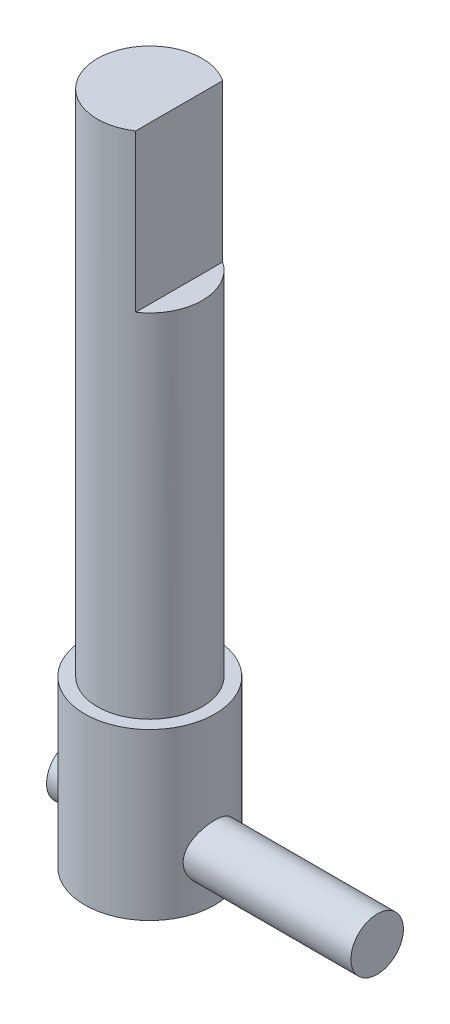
ISO-10303-21;
HEADER;
FILE_DESCRIPTION(('STEP AP214'),'2;1');
FILE_NAME('part.step','',(''),(''),'','','');
FILE_SCHEMA(('AUTOMOTIVE_DESIGN { 1 0 10303 214 1 1 1 1 }'));
ENDSEC;
DATA;
#1=APPLICATION_CONTEXT('core data for automotive mechanical design processes');
#2=APPLICATION_PROTOCOL_DEFINITION('international standard','automotive_design',2000,#1);
#3=PRODUCT_CONTEXT('',#1,'mechanical');
#4=PRODUCT('Part','Part','',(#3));
#5=PRODUCT_RELATED_PRODUCT_CATEGORY('part','',(#4));
#6=PRODUCT_DEFINITION_FORMATION('','',#4);
#7=PRODUCT_DEFINITION_CONTEXT('part definition',#1,'design');
#8=PRODUCT_DEFINITION('design','',#6,#7);
#9=PRODUCT_DEFINITION_SHAPE('','',#8);
#10=(LENGTH_UNIT() NAMED_UNIT(*) SI_UNIT(.MILLI.,.METRE.));
#11=(NAMED_UNIT(*) PLANE_ANGLE_UNIT() SI_UNIT($,.RADIAN.));
#12=(NAMED_UNIT(*) SI_UNIT($,.STERADIAN.) SOLID_ANGLE_UNIT());
#13=UNCERTAINTY_MEASURE_WITH_UNIT(LENGTH_MEASURE(1.E-05),#10,'distance_accuracy_value','');
#14=(GEOMETRIC_REPRESENTATION_CONTEXT(3) GLOBAL_UNCERTAINTY_ASSIGNED_CONTEXT((#13)) GLOBAL_UNIT_ASSIGNED_CONTEXT((#10,
#11,#12)) REPRESENTATION_CONTEXT('',''));
#15=CARTESIAN_POINT('',(0.,0.,0.));
#16=DIRECTION('',(0.,0.,1.));
#17=DIRECTION('',(1.,0.,0.));
#18=AXIS2_PLACEMENT_3D('',#15,#16,#17);
#19=CARTESIAN_POINT('',(0.,0.,0.));
#20=DIRECTION('',(0.,1.,0.));
#21=DIRECTION('',(0.,0.,1.));
#22=AXIS2_PLACEMENT_3D('',#19,#20,#21);
#23=PLANE('',#22);
#24=CARTESIAN_POINT('',(0.,0.,0.));
#25=DIRECTION('',(0.,-1.,0.));
#26=DIRECTION('',(0.,0.,-1.));
#27=AXIS2_PLACEMENT_3D('',#24,#25,#26);
#28=CIRCLE('',#27,3.937);
#29=CARTESIAN_POINT('',(0.,0.,-3.937));
#30=VERTEX_POINT('',#29);
#31=EDGE_CURVE('E66',#30,#30,#28,.T.);
#32=ORIENTED_EDGE('',*,*,#31,.T.);
#33=EDGE_LOOP('',(#32));
#34=FACE_BOUND('',#33,.T.);
#35=ADVANCED_FACE('F33',(#34),#23,.F.);
#36=CARTESIAN_POINT('',(0.,0.,0.));
#37=DIRECTION('',(0.,-1.,0.));
#38=DIRECTION('',(0.,0.,-1.));
#39=AXIS2_PLACEMENT_3D('',#36,#37,#38);
#40=CYLINDRICAL_SURFACE('',#39,3.937);
#41=CARTESIAN_POINT('',(-3.60275071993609,2.8575,-1.5875));
#42=CARTESIAN_POINT('',(-3.60275845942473,2.94244815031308,-1.58749178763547));
#43=CARTESIAN_POINT('',(-3.60579861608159,3.0275458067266,-1.58063852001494));
#44=CARTESIAN_POINT('',(-3.61757731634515,3.19530173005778,-1.5534827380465));
#45=CARTESIAN_POINT('',(-3.62633177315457,3.27795250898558,-1.53314266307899));
#46=CARTESIAN_POINT('',(-3.64837385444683,3.43809246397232,-1.47991792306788));
#47=CARTESIAN_POINT('',(-3.66164377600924,3.51560040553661,-1.44708218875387));
#48=CARTESIAN_POINT('',(-3.69119618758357,3.66398298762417,-1.36994114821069));
#49=CARTESIAN_POINT('',(-3.7074778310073,3.73485948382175,-1.32563906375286));
#50=CARTESIAN_POINT('',(-3.74228008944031,3.87213791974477,-1.22406482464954));
#51=CARTESIAN_POINT('',(-3.76087350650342,3.93810658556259,-1.16623175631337));
#52=CARTESIAN_POINT('',(-3.7976037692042,4.05972668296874,-1.04041666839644));
#53=CARTESIAN_POINT('',(-3.8157404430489,4.11537428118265,-0.972430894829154));
#54=CARTESIAN_POINT('',(-3.85038896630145,4.21693215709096,-0.824884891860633));
#55=CARTESIAN_POINT('',(-3.86680628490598,4.26236151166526,-0.744969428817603));
#56=CARTESIAN_POINT('',(-3.89528264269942,4.33894642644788,-0.577850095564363));
#57=CARTESIAN_POINT('',(-3.90734349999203,4.37010794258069,-0.490649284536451));
#58=CARTESIAN_POINT('',(-3.92523268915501,4.41572253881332,-0.315976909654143));
#59=CARTESIAN_POINT('',(-3.93133799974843,4.43092098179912,-0.22872893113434));
#60=CARTESIAN_POINT('',(-3.93763026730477,4.44657970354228,-0.0527216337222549));
#61=CARTESIAN_POINT('',(-3.93781946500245,4.44704556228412,0.0360371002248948));
#62=CARTESIAN_POINT('',(-3.93242568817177,4.43363107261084,0.207152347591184));
#63=CARTESIAN_POINT('',(-3.92717147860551,4.42056785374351,0.289585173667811));
#64=CARTESIAN_POINT('',(-3.91192599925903,4.38185797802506,0.45097321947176));
#65=CARTESIAN_POINT('',(-3.90193438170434,4.35621039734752,0.529928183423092));
#66=CARTESIAN_POINT('',(-3.87799836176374,4.29274641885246,0.683547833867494));
#67=CARTESIAN_POINT('',(-3.86399648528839,4.25475191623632,0.758129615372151));
#68=CARTESIAN_POINT('',(-3.83342579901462,4.16784089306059,0.90005197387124));
#69=CARTESIAN_POINT('',(-3.81685610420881,4.11892060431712,0.967390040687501));
#70=CARTESIAN_POINT('',(-3.78152551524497,4.00775172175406,1.09767458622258));
#71=CARTESIAN_POINT('',(-3.76269218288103,3.94483254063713,1.1600300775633));
#72=CARTESIAN_POINT('',(-3.72580351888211,3.80936261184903,1.27354920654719));
#73=CARTESIAN_POINT('',(-3.70774845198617,3.73680862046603,1.32470905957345));
#74=CARTESIAN_POINT('',(-3.67396318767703,3.58144424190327,1.41576747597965));
#75=CARTESIAN_POINT('',(-3.65831594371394,3.49839681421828,1.45529496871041));
#76=CARTESIAN_POINT('',(-3.6320934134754,3.32602537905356,1.51956761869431));
#77=CARTESIAN_POINT('',(-3.62151477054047,3.2367055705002,1.54432256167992));
#78=CARTESIAN_POINT('',(-3.60744527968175,3.06022583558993,1.5768973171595));
#79=CARTESIAN_POINT('',(-3.60355658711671,2.97327390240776,1.58566970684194));
#80=CARTESIAN_POINT('',(-3.60217304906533,2.79907237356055,1.58881236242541));
#81=CARTESIAN_POINT('',(-3.60467621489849,2.71182287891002,1.58318710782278));
#82=CARTESIAN_POINT('',(-3.61538551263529,2.54485081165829,1.55856187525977));
#83=CARTESIAN_POINT('',(-3.62325080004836,2.4649859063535,1.54036042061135));
#84=CARTESIAN_POINT('',(-3.64337287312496,2.30949902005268,1.49213960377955));
#85=CARTESIAN_POINT('',(-3.65563064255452,2.2338779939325,1.46211759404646));
#86=CARTESIAN_POINT('',(-3.68376972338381,2.08557338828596,1.38973797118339));
#87=CARTESIAN_POINT('',(-3.69977878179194,2.01313662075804,1.34692586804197));
#88=CARTESIAN_POINT('',(-3.73342437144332,1.87614211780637,1.2506435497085));
#89=CARTESIAN_POINT('',(-3.75106157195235,1.81158764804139,1.19716894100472));
#90=CARTESIAN_POINT('',(-3.78757942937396,1.68713701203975,1.07632786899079));
#91=CARTESIAN_POINT('',(-3.80645372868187,1.62795749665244,1.00821861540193));
#92=CARTESIAN_POINT('',(-3.84207293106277,1.52175322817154,0.862587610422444));
#93=CARTESIAN_POINT('',(-3.85881773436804,1.47472904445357,0.785065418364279));
#94=CARTESIAN_POINT('',(-3.88835427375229,1.39432240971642,0.622486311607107));
#95=CARTESIAN_POINT('',(-3.90114498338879,1.36094350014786,0.537427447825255));
#96=CARTESIAN_POINT('',(-3.92128698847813,1.30919345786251,0.362258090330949));
#97=CARTESIAN_POINT('',(-3.92864129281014,1.29081402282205,0.272150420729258));
#98=CARTESIAN_POINT('',(-3.93675586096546,1.27058133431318,0.0958700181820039));
#99=CARTESIAN_POINT('',(-3.93792011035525,1.26771537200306,0.00983124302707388));
#100=CARTESIAN_POINT('',(-3.93461977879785,1.27590743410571,-0.161461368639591));
#101=CARTESIAN_POINT('',(-3.93015607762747,1.28696328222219,-0.246715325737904));
#102=CARTESIAN_POINT('',(-3.91630556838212,1.32196042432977,-0.411252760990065));
#103=CARTESIAN_POINT('',(-3.90707883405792,1.3454833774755,-0.490639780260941));
#104=CARTESIAN_POINT('',(-3.88469462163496,1.4043045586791,-0.644323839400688));
#105=CARTESIAN_POINT('',(-3.87153637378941,1.43960509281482,-0.718619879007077));
#106=CARTESIAN_POINT('',(-3.84185015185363,1.52274466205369,-0.863642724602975));
#107=CARTESIAN_POINT('',(-3.82519840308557,1.57107123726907,-0.934064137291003));
#108=CARTESIAN_POINT('',(-3.79052601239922,1.67816166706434,-1.06609026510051));
#109=CARTESIAN_POINT('',(-3.77250490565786,1.7369290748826,-1.12769196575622));
#110=CARTESIAN_POINT('',(-3.73571045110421,1.8676062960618,-1.24435196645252));
#111=CARTESIAN_POINT('',(-3.71696114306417,1.94011047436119,-1.2987544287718));
#112=CARTESIAN_POINT('',(-3.68203922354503,2.09383170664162,-1.39469495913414));
#113=CARTESIAN_POINT('',(-3.66586801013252,2.1750534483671,-1.43622605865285));
#114=CARTESIAN_POINT('',(-3.63831341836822,2.34336142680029,-1.50465979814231));
#115=CARTESIAN_POINT('',(-3.626889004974,2.43038951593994,-1.53168842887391));
#116=CARTESIAN_POINT('',(-3.61029232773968,2.60819117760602,-1.57042088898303));
#117=CARTESIAN_POINT('',(-3.60509909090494,2.69895111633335,-1.58217613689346));
#118=CARTESIAN_POINT('',(-3.60296000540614,2.8124414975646,-1.58702266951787));
#119=CARTESIAN_POINT('',(-3.60274866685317,2.83496548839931,-1.58750217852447));
#120=CARTESIAN_POINT('',(-3.60275071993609,2.8575,-1.5875));
#121=B_SPLINE_CURVE_WITH_KNOTS('',3,(#41,#42,#43,#44,#45,#46,#47,#48,#49,#50,#51,#52,#53,#54,
#55,#56,#57,#58,#59,#60,#61,#62,#63,#64,#65,#66,#67,#68,#69,#70,#71,#72,#73,#74,#75,#76,#77,#78,
#79,#80,#81,#82,#83,#84,#85,#86,#87,#88,#89,#90,#91,#92,#93,#94,#95,#96,#97,#98,#99,#100,#101,
#102,#103,#104,#105,#106,#107,#108,#109,#110,#111,#112,#113,#114,#115,#116,#117,#118,#119,#120),
.UNSPECIFIED.,.T.,.F.,(4,2,2,2,2,2,2,2,2,2,2,2,2,2,2,2,2,2,2,2,2,2,2,2,2,2,2,2,2,2,2,2,2,2,2,2,
2,2,2,4),(0.,0.254783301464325,0.510279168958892,0.76478468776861,1.01921877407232,
1.28707474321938,1.55502999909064,1.83374864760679,2.1123508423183,2.37727156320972,
2.64209194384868,2.89180071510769,3.14152782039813,3.39503026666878,3.64862027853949,
3.91909607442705,4.18966316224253,4.46810459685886,4.74636137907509,5.00741123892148,
5.26837988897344,5.51414044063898,5.75995606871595,6.01583015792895,6.27180989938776,
6.54706226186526,6.82232751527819,7.09766416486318,7.3728483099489,7.62983044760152,
7.88677241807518,8.13559273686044,8.38446180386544,8.64439179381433,8.90441041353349,
9.18079395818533,9.45732687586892,9.73141682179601,10.0045816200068,10.0721689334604),.UNSPECIFIED.);
#122=CARTESIAN_POINT('',(-3.60275071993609,2.8575,-1.5875));
#123=VERTEX_POINT('',#122);
#124=EDGE_CURVE('E36',#123,#123,#121,.T.);
#125=ORIENTED_EDGE('',*,*,#124,.T.);
#126=EDGE_LOOP('',(#125));
#127=FACE_BOUND('',#126,.T.);
#128=CARTESIAN_POINT('',(3.60275071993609,2.8575,-1.5875));
#129=CARTESIAN_POINT('',(3.60275845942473,2.77255184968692,-1.58749178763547));
#130=CARTESIAN_POINT('',(3.60579861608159,2.6874541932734,-1.58063852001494));
#131=CARTESIAN_POINT('',(3.61757731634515,2.51969826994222,-1.5534827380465));
#132=CARTESIAN_POINT('',(3.62633177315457,2.43704749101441,-1.53314266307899));
#133=CARTESIAN_POINT('',(3.64837385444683,2.27690753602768,-1.47991792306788));
#134=CARTESIAN_POINT('',(3.66164377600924,2.19939959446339,-1.44708218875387));
#135=CARTESIAN_POINT('',(3.69119618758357,2.05101701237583,-1.36994114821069));
#136=CARTESIAN_POINT('',(3.7074778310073,1.98014051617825,-1.32563906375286));
#137=CARTESIAN_POINT('',(3.74228008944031,1.84286208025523,-1.22406482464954));
#138=CARTESIAN_POINT('',(3.76087350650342,1.77689341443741,-1.16623175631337));
#139=CARTESIAN_POINT('',(3.7976037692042,1.65527331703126,-1.04041666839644));
#140=CARTESIAN_POINT('',(3.8157404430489,1.59962571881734,-0.972430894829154));
#141=CARTESIAN_POINT('',(3.85038896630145,1.49806784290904,-0.824884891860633));
#142=CARTESIAN_POINT('',(3.86680628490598,1.45263848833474,-0.744969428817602));
#143=CARTESIAN_POINT('',(3.89528264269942,1.37605357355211,-0.577850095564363));
#144=CARTESIAN_POINT('',(3.90734349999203,1.34489205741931,-0.490649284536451));
#145=CARTESIAN_POINT('',(3.92523268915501,1.29927746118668,-0.315976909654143));
#146=CARTESIAN_POINT('',(3.93133799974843,1.28407901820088,-0.22872893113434));
#147=CARTESIAN_POINT('',(3.93763026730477,1.26842029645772,-0.052721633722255));
#148=CARTESIAN_POINT('',(3.93781946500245,1.26795443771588,0.0360371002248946));
#149=CARTESIAN_POINT('',(3.93242568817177,1.28136892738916,0.207152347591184));
#150=CARTESIAN_POINT('',(3.92717147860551,1.29443214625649,0.289585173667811));
#151=CARTESIAN_POINT('',(3.91192599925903,1.33314202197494,0.45097321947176));
#152=CARTESIAN_POINT('',(3.90193438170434,1.35878960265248,0.529928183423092));
#153=CARTESIAN_POINT('',(3.87799836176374,1.42225358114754,0.683547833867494));
#154=CARTESIAN_POINT('',(3.86399648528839,1.46024808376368,0.758129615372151));
#155=CARTESIAN_POINT('',(3.83342579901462,1.54715910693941,0.90005197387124));
#156=CARTESIAN_POINT('',(3.81685610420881,1.59607939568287,0.967390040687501));
#157=CARTESIAN_POINT('',(3.78152551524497,1.70724827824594,1.09767458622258));
#158=CARTESIAN_POINT('',(3.76269218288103,1.77016745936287,1.1600300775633));
#159=CARTESIAN_POINT('',(3.72580351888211,1.90563738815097,1.27354920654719));
#160=CARTESIAN_POINT('',(3.70774845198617,1.97819137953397,1.32470905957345));
#161=CARTESIAN_POINT('',(3.67396318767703,2.13355575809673,1.41576747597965));
#162=CARTESIAN_POINT('',(3.65831594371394,2.21660318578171,1.45529496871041));
#163=CARTESIAN_POINT('',(3.6320934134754,2.38897462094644,1.51956761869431));
#164=CARTESIAN_POINT('',(3.62151477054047,2.4782944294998,1.54432256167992));
#165=CARTESIAN_POINT('',(3.60744527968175,2.65477416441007,1.5768973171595));
#166=CARTESIAN_POINT('',(3.60355658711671,2.74172609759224,1.58566970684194));
#167=CARTESIAN_POINT('',(3.60217304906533,2.91592762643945,1.58881236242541));
#168=CARTESIAN_POINT('',(3.60467621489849,3.00317712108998,1.58318710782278));
#169=CARTESIAN_POINT('',(3.61538551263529,3.1701491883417,1.55856187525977));
#170=CARTESIAN_POINT('',(3.62325080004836,3.2500140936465,1.54036042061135));
#171=CARTESIAN_POINT('',(3.64337287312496,3.40550097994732,1.49213960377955));
#172=CARTESIAN_POINT('',(3.65563064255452,3.4811220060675,1.46211759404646));
#173=CARTESIAN_POINT('',(3.68376972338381,3.62942661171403,1.38973797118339));
#174=CARTESIAN_POINT('',(3.69977878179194,3.70186337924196,1.34692586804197));
#175=CARTESIAN_POINT('',(3.73342437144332,3.83885788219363,1.2506435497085));
#176=CARTESIAN_POINT('',(3.75106157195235,3.90341235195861,1.19716894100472));
#177=CARTESIAN_POINT('',(3.78757942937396,4.02786298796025,1.07632786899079));
#178=CARTESIAN_POINT('',(3.80645372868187,4.08704250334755,1.00821861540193));
#179=CARTESIAN_POINT('',(3.84207293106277,4.19324677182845,0.862587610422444));
#180=CARTESIAN_POINT('',(3.85881773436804,4.24027095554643,0.785065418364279));
#181=CARTESIAN_POINT('',(3.88835427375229,4.32067759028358,0.622486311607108));
#182=CARTESIAN_POINT('',(3.90114498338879,4.35405649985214,0.537427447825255));
#183=CARTESIAN_POINT('',(3.92128698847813,4.40580654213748,0.362258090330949));
#184=CARTESIAN_POINT('',(3.92864129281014,4.42418597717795,0.272150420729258));
#185=CARTESIAN_POINT('',(3.93675586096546,4.44441866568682,0.0958700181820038));
#186=CARTESIAN_POINT('',(3.93792011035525,4.44728462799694,0.009831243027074));
#187=CARTESIAN_POINT('',(3.93461977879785,4.43909256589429,-0.161461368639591));
#188=CARTESIAN_POINT('',(3.93015607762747,4.42803671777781,-0.246715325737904));
#189=CARTESIAN_POINT('',(3.91630556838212,4.39303957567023,-0.411252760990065));
#190=CARTESIAN_POINT('',(3.90707883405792,4.3695166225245,-0.490639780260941));
#191=CARTESIAN_POINT('',(3.88469462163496,4.3106954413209,-0.644323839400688));
#192=CARTESIAN_POINT('',(3.87153637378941,4.27539490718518,-0.718619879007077));
#193=CARTESIAN_POINT('',(3.84185015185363,4.19225533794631,-0.863642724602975));
#194=CARTESIAN_POINT('',(3.82519840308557,4.14392876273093,-0.934064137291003));
#195=CARTESIAN_POINT('',(3.79052601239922,4.03683833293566,-1.06609026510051));
#196=CARTESIAN_POINT('',(3.77250490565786,3.9780709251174,-1.12769196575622));
#197=CARTESIAN_POINT('',(3.73571045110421,3.8473937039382,-1.24435196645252));
#198=CARTESIAN_POINT('',(3.71696114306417,3.77488952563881,-1.2987544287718));
#199=CARTESIAN_POINT('',(3.68203922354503,3.62116829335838,-1.39469495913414));
#200=CARTESIAN_POINT('',(3.66586801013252,3.5399465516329,-1.43622605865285));
#201=CARTESIAN_POINT('',(3.63831341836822,3.37163857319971,-1.50465979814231));
#202=CARTESIAN_POINT('',(3.626889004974,3.28461048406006,-1.53168842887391));
#203=CARTESIAN_POINT('',(3.61029232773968,3.10680882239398,-1.57042088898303));
#204=CARTESIAN_POINT('',(3.60509909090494,3.01604888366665,-1.58217613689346));
#205=CARTESIAN_POINT('',(3.60296000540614,2.9025585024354,-1.58702266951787));
#206=CARTESIAN_POINT('',(3.60274866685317,2.88003451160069,-1.58750217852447));
#207=CARTESIAN_POINT('',(3.60275071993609,2.8575,-1.5875));
#208=B_SPLINE_CURVE_WITH_KNOTS('',3,(#128,#129,#130,#131,#132,#133,#134,#135,#136,#137,#138,
#139,#140,#141,#142,#143,#144,#145,#146,#147,#148,#149,#150,#151,#152,#153,#154,#155,#156,#157,
#158,#159,#160,#161,#162,#163,#164,#165,#166,#167,#168,#169,#170,#171,#172,#173,#174,#175,#176,
#177,#178,#179,#180,#181,#182,#183,#184,#185,#186,#187,#188,#189,#190,#191,#192,#193,#194,#195,
#196,#197,#198,#199,#200,#201,#202,#203,#204,#205,#206,#207),.UNSPECIFIED.,.T.,.F.,(4,2,2,2,2,2,
2,2,2,2,2,2,2,2,2,2,2,2,2,2,2,2,2,2,2,2,2,2,2,2,2,2,2,2,2,2,2,2,2,4),(0.,0.254783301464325,
0.510279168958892,0.76478468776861,1.01921877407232,1.28707474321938,1.55502999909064,
1.83374864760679,2.1123508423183,2.37727156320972,2.64209194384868,2.89180071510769,
3.14152782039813,3.39503026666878,3.64862027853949,3.91909607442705,4.18966316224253,
4.46810459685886,4.74636137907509,5.00741123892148,5.26837988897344,5.51414044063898,
5.75995606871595,6.01583015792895,6.27180989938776,6.54706226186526,6.82232751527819,
7.09766416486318,7.37284830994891,7.62983044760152,7.88677241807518,8.13559273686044,
8.38446180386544,8.64439179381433,8.90441041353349,9.18079395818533,9.45732687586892,
9.73141682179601,10.0045816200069,10.0721689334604),.UNSPECIFIED.);
#209=CARTESIAN_POINT('',(3.60275071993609,2.8575,-1.5875));
#210=VERTEX_POINT('',#209);
#211=EDGE_CURVE('E86',#210,#210,#208,.T.);
#212=ORIENTED_EDGE('',*,*,#211,.T.);
#213=EDGE_LOOP('',(#212));
#214=FACE_BOUND('',#213,.T.);
#215=ORIENTED_EDGE('',*,*,#31,.F.);
#216=EDGE_LOOP('',(#215));
#217=FACE_BOUND('',#216,.T.);
#218=CARTESIAN_POINT('',(0.,10.0076,0.));
#219=DIRECTION('',(0.,-1.,0.));
#220=DIRECTION('',(0.,0.,-1.));
#221=AXIS2_PLACEMENT_3D('',#218,#219,#220);
#222=CIRCLE('',#221,3.937);
#223=CARTESIAN_POINT('',(0.,10.0076,-3.937));
#224=VERTEX_POINT('',#223);
#225=EDGE_CURVE('E79',#224,#224,#222,.T.);
#226=ORIENTED_EDGE('',*,*,#225,.T.);
#227=EDGE_LOOP('',(#226));
#228=FACE_BOUND('',#227,.T.);
#229=ADVANCED_FACE('F91',(#127,#214,#217,#228),#40,.T.);
#230=CARTESIAN_POINT('',(-3.937,10.0076,0.));
#231=DIRECTION('',(0.,-1.,0.));
#232=DIRECTION('',(0.,0.,-1.));
#233=AXIS2_PLACEMENT_3D('',#230,#231,#232);
#234=PLANE('',#233);
#235=ORIENTED_EDGE('',*,*,#225,.F.);
#236=EDGE_LOOP('',(#235));
#237=FACE_BOUND('',#236,.T.);
#238=CARTESIAN_POINT('',(0.,10.0076,0.));
#239=DIRECTION('',(0.,-1.,0.));
#240=DIRECTION('',(0.,0.,-1.));
#241=AXIS2_PLACEMENT_3D('',#238,#239,#240);
#242=CIRCLE('',#241,3.175);
#243=CARTESIAN_POINT('',(0.,10.0076,-3.175));
#244=VERTEX_POINT('',#243);
#245=EDGE_CURVE('E76',#244,#244,#242,.T.);
#246=ORIENTED_EDGE('',*,*,#245,.T.);
#247=EDGE_LOOP('',(#246));
#248=FACE_BOUND('',#247,.T.);
#249=ADVANCED_FACE('F114',(#237,#248),#234,.F.);
#250=CARTESIAN_POINT('',(0.,0.,0.));
#251=DIRECTION('',(0.,-1.,0.));
#252=DIRECTION('',(0.,0.,-1.));
#253=AXIS2_PLACEMENT_3D('',#250,#251,#252);
#254=CYLINDRICAL_SURFACE('',#253,3.175);
#255=CARTESIAN_POINT('',(0.,40.7924,0.));
#256=DIRECTION('',(0.,-1.,0.));
#257=DIRECTION('',(0.,0.,-1.));
#258=AXIS2_PLACEMENT_3D('',#255,#256,#257);
#259=CIRCLE('',#258,3.175);
#260=CARTESIAN_POINT('',(1.778,40.7924,2.63046402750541));
#261=VERTEX_POINT('',#260);
#262=CARTESIAN_POINT('',(1.778,40.7924,-2.63046402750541));
#263=VERTEX_POINT('',#262);
#264=EDGE_CURVE('E72',#261,#263,#259,.T.);
#265=ORIENTED_EDGE('',*,*,#264,.T.);
#266=DIRECTION('',(0.,-1.,0.));
#267=VECTOR('',#266,1.);
#268=CARTESIAN_POINT('',(1.778,0.,-2.63046402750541));
#269=LINE('',#268,#267);
#270=CARTESIAN_POINT('',(1.778,31.2928,-2.63046402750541));
#271=VERTEX_POINT('',#270);
#272=EDGE_CURVE('E52',#263,#271,#269,.T.);
#273=ORIENTED_EDGE('',*,*,#272,.T.);
#274=CARTESIAN_POINT('',(0.,31.2928,0.));
#275=DIRECTION('',(0.,1.,0.));
#276=DIRECTION('',(0.,0.,1.));
#277=AXIS2_PLACEMENT_3D('',#274,#275,#276);
#278=CIRCLE('',#277,3.175);
#279=CARTESIAN_POINT('',(1.778,31.2928,2.63046402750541));
#280=VERTEX_POINT('',#279);
#281=EDGE_CURVE('E11',#280,#271,#278,.T.);
#282=ORIENTED_EDGE('',*,*,#281,.F.);
#283=DIRECTION('',(0.,-1.,0.));
#284=VECTOR('',#283,1.);
#285=CARTESIAN_POINT('',(1.778,0.,2.63046402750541));
#286=LINE('',#285,#284);
#287=EDGE_CURVE('E57',#280,#261,#286,.F.);
#288=ORIENTED_EDGE('',*,*,#287,.T.);
#289=EDGE_LOOP('',(#265,#273,#282,#288));
#290=FACE_BOUND('',#289,.T.);
#291=ORIENTED_EDGE('',*,*,#245,.F.);
#292=EDGE_LOOP('',(#291));
#293=FACE_BOUND('',#292,.T.);
#294=ADVANCED_FACE('F70',(#290,#293),#254,.T.);
#295=CARTESIAN_POINT('',(-3.175,40.7924,0.));
#296=DIRECTION('',(0.,-1.,0.));
#297=DIRECTION('',(0.,0.,-1.));
#298=AXIS2_PLACEMENT_3D('',#295,#296,#297);
#299=PLANE('',#298);
#300=ORIENTED_EDGE('',*,*,#264,.F.);
#301=DIRECTION('',(0.,0.,-1.));
#302=VECTOR('',#301,1.);
#303=CARTESIAN_POINT('',(1.778,40.7924,0.));
#304=LINE('',#303,#302);
#305=EDGE_CURVE('E44',#261,#263,#304,.T.);
#306=ORIENTED_EDGE('',*,*,#305,.T.);
#307=EDGE_LOOP('',(#300,#306));
#308=FACE_BOUND('',#307,.T.);
#309=ADVANCED_FACE('F75',(#308),#299,.F.);
#310=CARTESIAN_POINT('',(0.,31.2928,0.));
#311=DIRECTION('',(0.,1.,0.));
#312=DIRECTION('',(0.,0.,1.));
#313=AXIS2_PLACEMENT_3D('',#310,#311,#312);
#314=PLANE('',#313);
#315=ORIENTED_EDGE('',*,*,#281,.T.);
#316=DIRECTION('',(0.,0.,1.));
#317=VECTOR('',#316,1.);
#318=CARTESIAN_POINT('',(1.778,31.2928,-6.0984429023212));
#319=LINE('',#318,#317);
#320=EDGE_CURVE('E73',#271,#280,#319,.T.);
#321=ORIENTED_EDGE('',*,*,#320,.T.);
#322=EDGE_LOOP('',(#315,#321));
#323=FACE_BOUND('',#322,.T.);
#324=ADVANCED_FACE('F103',(#323),#314,.T.);
#325=CARTESIAN_POINT('',(1.778,31.2928,-6.0984429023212));
#326=DIRECTION('',(-1.,0.,0.));
#327=DIRECTION('',(0.,0.,1.));
#328=AXIS2_PLACEMENT_3D('',#325,#326,#327);
#329=PLANE('',#328);
#330=ORIENTED_EDGE('',*,*,#305,.F.);
#331=ORIENTED_EDGE('',*,*,#287,.F.);
#332=ORIENTED_EDGE('',*,*,#320,.F.);
#333=ORIENTED_EDGE('',*,*,#272,.F.);
#334=EDGE_LOOP('',(#330,#331,#332,#333));
#335=FACE_BOUND('',#334,.T.);
#336=ADVANCED_FACE('F62',(#335),#329,.F.);
#337=CARTESIAN_POINT('',(13.7541,2.8575,0.));
#338=DIRECTION('',(1.,0.,0.));
#339=DIRECTION('',(0.,0.,-1.));
#340=AXIS2_PLACEMENT_3D('',#337,#338,#339);
#341=PLANE('',#340);
#342=CARTESIAN_POINT('',(13.7541,2.8575,0.));
#343=DIRECTION('',(1.,0.,0.));
#344=DIRECTION('',(0.,0.,-1.));
#345=AXIS2_PLACEMENT_3D('',#342,#343,#344);
#346=CIRCLE('',#345,1.5875);
#347=CARTESIAN_POINT('',(13.7541,2.8575,-1.5875));
#348=VERTEX_POINT('',#347);
#349=EDGE_CURVE('E175',#348,#348,#346,.T.);
#350=ORIENTED_EDGE('',*,*,#349,.T.);
#351=EDGE_LOOP('',(#350));
#352=FACE_BOUND('',#351,.T.);
#353=ADVANCED_FACE('F110',(#352),#341,.T.);
#354=CARTESIAN_POINT('',(-4.6609,2.8575,0.));
#355=DIRECTION('',(1.,0.,0.));
#356=DIRECTION('',(0.,0.,-1.));
#357=AXIS2_PLACEMENT_3D('',#354,#355,#356);
#358=CYLINDRICAL_SURFACE('',#357,1.5875);
#359=ORIENTED_EDGE('',*,*,#349,.F.);
#360=EDGE_LOOP('',(#359));
#361=FACE_BOUND('',#360,.T.);
#362=ORIENTED_EDGE('',*,*,#211,.F.);
#363=EDGE_LOOP('',(#362));
#364=FACE_BOUND('',#363,.T.);
#365=ADVANCED_FACE('F100',(#361,#364),#358,.T.);
#366=CARTESIAN_POINT('',(-4.6609,2.8575,0.));
#367=DIRECTION('',(1.,0.,0.));
#368=DIRECTION('',(0.,0.,-1.));
#369=AXIS2_PLACEMENT_3D('',#366,#367,#368);
#370=CIRCLE('',#369,1.5875);
#371=CARTESIAN_POINT('',(-4.6609,2.8575,-1.5875));
#372=VERTEX_POINT('',#371);
#373=EDGE_CURVE('E90',#372,#372,#370,.T.);
#374=ORIENTED_EDGE('',*,*,#373,.T.);
#375=EDGE_LOOP('',(#374));
#376=FACE_BOUND('',#375,.T.);
#377=ORIENTED_EDGE('',*,*,#124,.F.);
#378=EDGE_LOOP('',(#377));
#379=FACE_BOUND('',#378,.T.);
#380=ADVANCED_FACE('F94',(#376,#379),#358,.T.);
#381=CARTESIAN_POINT('',(-4.6609,2.8575,0.));
#382=DIRECTION('',(1.,0.,0.));
#383=DIRECTION('',(0.,0.,-1.));
#384=AXIS2_PLACEMENT_3D('',#381,#382,#383);
#385=PLANE('',#384);
#386=ORIENTED_EDGE('',*,*,#373,.F.);
#387=EDGE_LOOP('',(#386));
#388=FACE_BOUND('',#387,.T.);
#389=ADVANCED_FACE('F99',(#388),#385,.F.);
#390=CLOSED_SHELL('',(#35,#229,#249,#294,#309,#324,#336,#353,#365,#380,#389));
#391=MANIFOLD_SOLID_BREP('B2',#390);
#392=ADVANCED_BREP_SHAPE_REPRESENTATION('',(#18,#391),#14);
#393=SHAPE_DEFINITION_REPRESENTATION(#9,#392);
ENDSEC;
END-ISO-10303-21;
